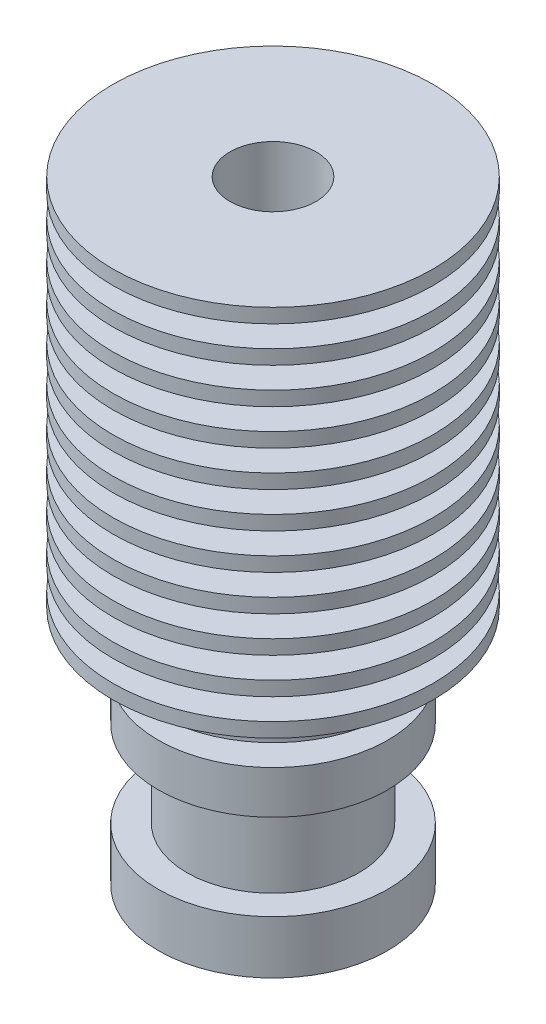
ISO-10303-21;
HEADER;
FILE_DESCRIPTION(('STEP AP214'),'2;1');
FILE_NAME('part.step','',(''),(''),'','','');
FILE_SCHEMA(('AUTOMOTIVE_DESIGN { 1 0 10303 214 1 1 1 1 }'));
ENDSEC;
DATA;
#1=APPLICATION_CONTEXT('core data for automotive mechanical design processes');
#2=APPLICATION_PROTOCOL_DEFINITION('international standard','automotive_design',2000,#1);
#3=PRODUCT_CONTEXT('',#1,'mechanical');
#4=PRODUCT('Part','Part','',(#3));
#5=PRODUCT_RELATED_PRODUCT_CATEGORY('part','',(#4));
#6=PRODUCT_DEFINITION_FORMATION('','',#4);
#7=PRODUCT_DEFINITION_CONTEXT('part definition',#1,'design');
#8=PRODUCT_DEFINITION('design','',#6,#7);
#9=PRODUCT_DEFINITION_SHAPE('','',#8);
#10=(LENGTH_UNIT() NAMED_UNIT(*) SI_UNIT(.MILLI.,.METRE.));
#11=(NAMED_UNIT(*) PLANE_ANGLE_UNIT() SI_UNIT($,.RADIAN.));
#12=(NAMED_UNIT(*) SI_UNIT($,.STERADIAN.) SOLID_ANGLE_UNIT());
#13=UNCERTAINTY_MEASURE_WITH_UNIT(LENGTH_MEASURE(1.E-05),#10,'distance_accuracy_value','');
#14=(GEOMETRIC_REPRESENTATION_CONTEXT(3) GLOBAL_UNCERTAINTY_ASSIGNED_CONTEXT((#13)) GLOBAL_UNIT_ASSIGNED_CONTEXT((#10,
#11,#12)) REPRESENTATION_CONTEXT('',''));
#15=CARTESIAN_POINT('',(0.,0.,0.));
#16=DIRECTION('',(0.,0.,1.));
#17=DIRECTION('',(1.,0.,0.));
#18=AXIS2_PLACEMENT_3D('',#15,#16,#17);
#19=CARTESIAN_POINT('',(0.,0.,0.));
#20=DIRECTION('',(0.,1.,0.));
#21=DIRECTION('',(0.,0.,1.));
#22=AXIS2_PLACEMENT_3D('',#19,#20,#21);
#23=PLANE('',#22);
#24=CARTESIAN_POINT('',(0.,0.,0.));
#25=DIRECTION('',(0.,1.,0.));
#26=DIRECTION('',(0.,0.,1.));
#27=AXIS2_PLACEMENT_3D('',#24,#25,#26);
#28=CIRCLE('',#27,8.);
#29=CARTESIAN_POINT('',(0.,0.,8.));
#30=VERTEX_POINT('',#29);
#31=EDGE_CURVE('E161',#30,#30,#28,.T.);
#32=ORIENTED_EDGE('',*,*,#31,.F.);
#33=EDGE_LOOP('',(#32));
#34=FACE_BOUND('',#33,.T.);
#35=CARTESIAN_POINT('',(0.,0.,0.));
#36=DIRECTION('',(0.,-1.,0.));
#37=DIRECTION('',(0.,0.,-1.));
#38=AXIS2_PLACEMENT_3D('',#35,#36,#37);
#39=CIRCLE('',#38,2.1);
#40=CARTESIAN_POINT('',(0.,0.,-2.1));
#41=VERTEX_POINT('',#40);
#42=EDGE_CURVE('E848',#41,#41,#39,.T.);
#43=ORIENTED_EDGE('',*,*,#42,.F.);
#44=EDGE_LOOP('',(#43));
#45=FACE_BOUND('',#44,.T.);
#46=ADVANCED_FACE('F35',(#34,#45),#23,.F.);
#47=CARTESIAN_POINT('',(0.,12.7,0.));
#48=DIRECTION('',(0.,1.,0.));
#49=DIRECTION('',(0.,0.,1.));
#50=AXIS2_PLACEMENT_3D('',#47,#48,#49);
#51=CONICAL_SURFACE('',#50,4.5,0.05235987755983);
#52=CARTESIAN_POINT('',(0.,40.2,0.));
#53=DIRECTION('',(0.,1.,0.));
#54=DIRECTION('',(0.,0.,1.));
#55=AXIS2_PLACEMENT_3D('',#52,#53,#54);
#56=CIRCLE('',#55,5.94121393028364);
#57=CARTESIAN_POINT('',(0.,40.2,5.94121393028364));
#58=VERTEX_POINT('',#57);
#59=EDGE_CURVE('E55',#58,#58,#56,.T.);
#60=ORIENTED_EDGE('',*,*,#59,.T.);
#61=EDGE_LOOP('',(#60));
#62=FACE_BOUND('',#61,.T.);
#63=CARTESIAN_POINT('',(0.,41.7,0.));
#64=DIRECTION('',(0.,1.,0.));
#65=DIRECTION('',(0.,0.,1.));
#66=AXIS2_PLACEMENT_3D('',#63,#64,#65);
#67=CIRCLE('',#66,6.0198255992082);
#68=CARTESIAN_POINT('',(0.,41.7,6.0198255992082));
#69=VERTEX_POINT('',#68);
#70=EDGE_CURVE('E10',#69,#69,#67,.T.);
#71=ORIENTED_EDGE('',*,*,#70,.F.);
#72=EDGE_LOOP('',(#71));
#73=FACE_BOUND('',#72,.T.);
#74=ADVANCED_FACE('F237',(#62,#73),#51,.T.);
#75=CARTESIAN_POINT('',(0.,37.7,0.));
#76=DIRECTION('',(0.,1.,0.));
#77=DIRECTION('',(0.,0.,1.));
#78=AXIS2_PLACEMENT_3D('',#75,#76,#77);
#79=CIRCLE('',#78,5.81019448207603);
#80=CARTESIAN_POINT('',(0.,37.7,5.81019448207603));
#81=VERTEX_POINT('',#80);
#82=EDGE_CURVE('E54',#81,#81,#79,.T.);
#83=ORIENTED_EDGE('',*,*,#82,.T.);
#84=EDGE_LOOP('',(#83));
#85=FACE_BOUND('',#84,.T.);
#86=CARTESIAN_POINT('',(0.,39.2,0.));
#87=DIRECTION('',(0.,1.,0.));
#88=DIRECTION('',(0.,0.,1.));
#89=AXIS2_PLACEMENT_3D('',#86,#87,#88);
#90=CIRCLE('',#89,5.8888061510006);
#91=CARTESIAN_POINT('',(0.,39.2,5.8888061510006));
#92=VERTEX_POINT('',#91);
#93=EDGE_CURVE('E42',#92,#92,#90,.T.);
#94=ORIENTED_EDGE('',*,*,#93,.F.);
#95=EDGE_LOOP('',(#94));
#96=FACE_BOUND('',#95,.T.);
#97=ADVANCED_FACE('F242',(#85,#96),#51,.T.);
#98=CARTESIAN_POINT('',(0.,35.2,0.));
#99=DIRECTION('',(0.,1.,0.));
#100=DIRECTION('',(0.,0.,1.));
#101=AXIS2_PLACEMENT_3D('',#98,#99,#100);
#102=CIRCLE('',#101,5.67917503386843);
#103=CARTESIAN_POINT('',(0.,35.2,5.67917503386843));
#104=VERTEX_POINT('',#103);
#105=EDGE_CURVE('E81',#104,#104,#102,.T.);
#106=ORIENTED_EDGE('',*,*,#105,.T.);
#107=EDGE_LOOP('',(#106));
#108=FACE_BOUND('',#107,.T.);
#109=CARTESIAN_POINT('',(0.,36.7,0.));
#110=DIRECTION('',(0.,1.,0.));
#111=DIRECTION('',(0.,0.,1.));
#112=AXIS2_PLACEMENT_3D('',#109,#110,#111);
#113=CIRCLE('',#112,5.75778670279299);
#114=CARTESIAN_POINT('',(0.,36.7,5.75778670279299));
#115=VERTEX_POINT('',#114);
#116=EDGE_CURVE('E46',#115,#115,#113,.T.);
#117=ORIENTED_EDGE('',*,*,#116,.F.);
#118=EDGE_LOOP('',(#117));
#119=FACE_BOUND('',#118,.T.);
#120=ADVANCED_FACE('F216',(#108,#119),#51,.T.);
#121=CARTESIAN_POINT('',(0.,32.7,0.));
#122=DIRECTION('',(0.,1.,0.));
#123=DIRECTION('',(0.,0.,1.));
#124=AXIS2_PLACEMENT_3D('',#121,#122,#123);
#125=CIRCLE('',#124,5.54815558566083);
#126=CARTESIAN_POINT('',(0.,32.7,5.54815558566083));
#127=VERTEX_POINT('',#126);
#128=EDGE_CURVE('E88',#127,#127,#125,.T.);
#129=ORIENTED_EDGE('',*,*,#128,.T.);
#130=EDGE_LOOP('',(#129));
#131=FACE_BOUND('',#130,.T.);
#132=CARTESIAN_POINT('',(0.,34.2,0.));
#133=DIRECTION('',(0.,1.,0.));
#134=DIRECTION('',(0.,0.,1.));
#135=AXIS2_PLACEMENT_3D('',#132,#133,#134);
#136=CIRCLE('',#135,5.62676725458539);
#137=CARTESIAN_POINT('',(0.,34.2,5.62676725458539));
#138=VERTEX_POINT('',#137);
#139=EDGE_CURVE('E51',#138,#138,#136,.T.);
#140=ORIENTED_EDGE('',*,*,#139,.F.);
#141=EDGE_LOOP('',(#140));
#142=FACE_BOUND('',#141,.T.);
#143=ADVANCED_FACE('F391',(#131,#142),#51,.T.);
#144=CARTESIAN_POINT('',(0.,30.2,0.));
#145=DIRECTION('',(0.,1.,0.));
#146=DIRECTION('',(0.,0.,1.));
#147=AXIS2_PLACEMENT_3D('',#144,#145,#146);
#148=CIRCLE('',#147,5.41713613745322);
#149=CARTESIAN_POINT('',(0.,30.2,5.41713613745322));
#150=VERTEX_POINT('',#149);
#151=EDGE_CURVE('E95',#150,#150,#148,.T.);
#152=ORIENTED_EDGE('',*,*,#151,.T.);
#153=EDGE_LOOP('',(#152));
#154=FACE_BOUND('',#153,.T.);
#155=CARTESIAN_POINT('',(0.,31.7,0.));
#156=DIRECTION('',(0.,1.,0.));
#157=DIRECTION('',(0.,0.,1.));
#158=AXIS2_PLACEMENT_3D('',#155,#156,#157);
#159=CIRCLE('',#158,5.49574780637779);
#160=CARTESIAN_POINT('',(0.,31.7,5.49574780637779));
#161=VERTEX_POINT('',#160);
#162=EDGE_CURVE('E204',#161,#161,#159,.T.);
#163=ORIENTED_EDGE('',*,*,#162,.F.);
#164=EDGE_LOOP('',(#163));
#165=FACE_BOUND('',#164,.T.);
#166=ADVANCED_FACE('F393',(#154,#165),#51,.T.);
#167=CARTESIAN_POINT('',(0.,27.7,0.));
#168=DIRECTION('',(0.,1.,0.));
#169=DIRECTION('',(0.,0.,1.));
#170=AXIS2_PLACEMENT_3D('',#167,#168,#169);
#171=CIRCLE('',#170,5.28611668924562);
#172=CARTESIAN_POINT('',(0.,27.7,5.28611668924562));
#173=VERTEX_POINT('',#172);
#174=EDGE_CURVE('E102',#173,#173,#171,.T.);
#175=ORIENTED_EDGE('',*,*,#174,.T.);
#176=EDGE_LOOP('',(#175));
#177=FACE_BOUND('',#176,.T.);
#178=CARTESIAN_POINT('',(0.,29.2,0.));
#179=DIRECTION('',(0.,1.,0.));
#180=DIRECTION('',(0.,0.,1.));
#181=AXIS2_PLACEMENT_3D('',#178,#179,#180);
#182=CIRCLE('',#181,5.36472835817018);
#183=CARTESIAN_POINT('',(0.,29.2,5.36472835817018));
#184=VERTEX_POINT('',#183);
#185=EDGE_CURVE('E199',#184,#184,#182,.T.);
#186=ORIENTED_EDGE('',*,*,#185,.F.);
#187=EDGE_LOOP('',(#186));
#188=FACE_BOUND('',#187,.T.);
#189=ADVANCED_FACE('F399',(#177,#188),#51,.T.);
#190=CARTESIAN_POINT('',(0.,25.2,0.));
#191=DIRECTION('',(0.,1.,0.));
#192=DIRECTION('',(0.,0.,1.));
#193=AXIS2_PLACEMENT_3D('',#190,#191,#192);
#194=CIRCLE('',#193,5.15509724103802);
#195=CARTESIAN_POINT('',(0.,25.2,5.15509724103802));
#196=VERTEX_POINT('',#195);
#197=EDGE_CURVE('E109',#196,#196,#194,.T.);
#198=ORIENTED_EDGE('',*,*,#197,.T.);
#199=EDGE_LOOP('',(#198));
#200=FACE_BOUND('',#199,.T.);
#201=CARTESIAN_POINT('',(0.,26.7,0.));
#202=DIRECTION('',(0.,1.,0.));
#203=DIRECTION('',(0.,0.,1.));
#204=AXIS2_PLACEMENT_3D('',#201,#202,#203);
#205=CIRCLE('',#204,5.23370890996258);
#206=CARTESIAN_POINT('',(0.,26.7,5.23370890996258));
#207=VERTEX_POINT('',#206);
#208=EDGE_CURVE('E194',#207,#207,#205,.T.);
#209=ORIENTED_EDGE('',*,*,#208,.F.);
#210=EDGE_LOOP('',(#209));
#211=FACE_BOUND('',#210,.T.);
#212=ADVANCED_FACE('F764',(#200,#211),#51,.T.);
#213=CARTESIAN_POINT('',(0.,22.7,0.));
#214=DIRECTION('',(0.,1.,0.));
#215=DIRECTION('',(0.,0.,1.));
#216=AXIS2_PLACEMENT_3D('',#213,#214,#215);
#217=CIRCLE('',#216,5.02407779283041);
#218=CARTESIAN_POINT('',(0.,22.7,5.02407779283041));
#219=VERTEX_POINT('',#218);
#220=EDGE_CURVE('E116',#219,#219,#217,.T.);
#221=ORIENTED_EDGE('',*,*,#220,.T.);
#222=EDGE_LOOP('',(#221));
#223=FACE_BOUND('',#222,.T.);
#224=CARTESIAN_POINT('',(0.,24.2,0.));
#225=DIRECTION('',(0.,1.,0.));
#226=DIRECTION('',(0.,0.,1.));
#227=AXIS2_PLACEMENT_3D('',#224,#225,#226);
#228=CIRCLE('',#227,5.10268946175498);
#229=CARTESIAN_POINT('',(0.,24.2,5.10268946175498));
#230=VERTEX_POINT('',#229);
#231=EDGE_CURVE('E189',#230,#230,#228,.T.);
#232=ORIENTED_EDGE('',*,*,#231,.F.);
#233=EDGE_LOOP('',(#232));
#234=FACE_BOUND('',#233,.T.);
#235=ADVANCED_FACE('F755',(#223,#234),#51,.T.);
#236=CARTESIAN_POINT('',(0.,20.2,0.));
#237=DIRECTION('',(0.,1.,0.));
#238=DIRECTION('',(0.,0.,1.));
#239=AXIS2_PLACEMENT_3D('',#236,#237,#238);
#240=CIRCLE('',#239,4.89305834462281);
#241=CARTESIAN_POINT('',(0.,20.2,4.89305834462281));
#242=VERTEX_POINT('',#241);
#243=EDGE_CURVE('E123',#242,#242,#240,.T.);
#244=ORIENTED_EDGE('',*,*,#243,.T.);
#245=EDGE_LOOP('',(#244));
#246=FACE_BOUND('',#245,.T.);
#247=CARTESIAN_POINT('',(0.,21.7,0.));
#248=DIRECTION('',(0.,1.,0.));
#249=DIRECTION('',(0.,0.,1.));
#250=AXIS2_PLACEMENT_3D('',#247,#248,#249);
#251=CIRCLE('',#250,4.97167001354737);
#252=CARTESIAN_POINT('',(0.,21.7,4.97167001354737));
#253=VERTEX_POINT('',#252);
#254=EDGE_CURVE('E184',#253,#253,#251,.T.);
#255=ORIENTED_EDGE('',*,*,#254,.F.);
#256=EDGE_LOOP('',(#255));
#257=FACE_BOUND('',#256,.T.);
#258=ADVANCED_FACE('F746',(#246,#257),#51,.T.);
#259=CARTESIAN_POINT('',(0.,17.7,0.));
#260=DIRECTION('',(0.,1.,0.));
#261=DIRECTION('',(0.,0.,1.));
#262=AXIS2_PLACEMENT_3D('',#259,#260,#261);
#263=CIRCLE('',#262,4.76203889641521);
#264=CARTESIAN_POINT('',(0.,17.7,4.76203889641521));
#265=VERTEX_POINT('',#264);
#266=EDGE_CURVE('E130',#265,#265,#263,.T.);
#267=ORIENTED_EDGE('',*,*,#266,.T.);
#268=EDGE_LOOP('',(#267));
#269=FACE_BOUND('',#268,.T.);
#270=CARTESIAN_POINT('',(0.,19.2,0.));
#271=DIRECTION('',(0.,1.,0.));
#272=DIRECTION('',(0.,0.,1.));
#273=AXIS2_PLACEMENT_3D('',#270,#271,#272);
#274=CIRCLE('',#273,4.84065056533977);
#275=CARTESIAN_POINT('',(0.,19.2,4.84065056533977));
#276=VERTEX_POINT('',#275);
#277=EDGE_CURVE('E179',#276,#276,#274,.T.);
#278=ORIENTED_EDGE('',*,*,#277,.F.);
#279=EDGE_LOOP('',(#278));
#280=FACE_BOUND('',#279,.T.);
#281=ADVANCED_FACE('F447',(#269,#280),#51,.T.);
#282=CARTESIAN_POINT('',(0.,15.2,0.));
#283=DIRECTION('',(0.,1.,0.));
#284=DIRECTION('',(0.,0.,1.));
#285=AXIS2_PLACEMENT_3D('',#282,#283,#284);
#286=CIRCLE('',#285,4.6310194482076);
#287=CARTESIAN_POINT('',(0.,15.2,4.6310194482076));
#288=VERTEX_POINT('',#287);
#289=EDGE_CURVE('E137',#288,#288,#286,.T.);
#290=ORIENTED_EDGE('',*,*,#289,.T.);
#291=EDGE_LOOP('',(#290));
#292=FACE_BOUND('',#291,.T.);
#293=CARTESIAN_POINT('',(0.,16.7,0.));
#294=DIRECTION('',(0.,1.,0.));
#295=DIRECTION('',(0.,0.,1.));
#296=AXIS2_PLACEMENT_3D('',#293,#294,#295);
#297=CIRCLE('',#296,4.70963111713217);
#298=CARTESIAN_POINT('',(0.,16.7,4.70963111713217));
#299=VERTEX_POINT('',#298);
#300=EDGE_CURVE('E174',#299,#299,#297,.T.);
#301=ORIENTED_EDGE('',*,*,#300,.F.);
#302=EDGE_LOOP('',(#301));
#303=FACE_BOUND('',#302,.T.);
#304=ADVANCED_FACE('F443',(#292,#303),#51,.T.);
#305=CARTESIAN_POINT('',(0.,12.7,0.));
#306=DIRECTION('',(0.,1.,0.));
#307=DIRECTION('',(0.,0.,1.));
#308=AXIS2_PLACEMENT_3D('',#305,#306,#307);
#309=CIRCLE('',#308,4.5);
#310=CARTESIAN_POINT('',(0.,12.7,4.5));
#311=VERTEX_POINT('',#310);
#312=EDGE_CURVE('E148',#311,#311,#309,.T.);
#313=ORIENTED_EDGE('',*,*,#312,.T.);
#314=EDGE_LOOP('',(#313));
#315=FACE_BOUND('',#314,.T.);
#316=CARTESIAN_POINT('',(0.,14.2,0.));
#317=DIRECTION('',(0.,1.,0.));
#318=DIRECTION('',(0.,0.,1.));
#319=AXIS2_PLACEMENT_3D('',#316,#317,#318);
#320=CIRCLE('',#319,4.57861166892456);
#321=CARTESIAN_POINT('',(0.,14.2,4.57861166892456));
#322=VERTEX_POINT('',#321);
#323=EDGE_CURVE('E167',#322,#322,#320,.T.);
#324=ORIENTED_EDGE('',*,*,#323,.F.);
#325=EDGE_LOOP('',(#324));
#326=FACE_BOUND('',#325,.T.);
#327=ADVANCED_FACE('F244',(#315,#326),#51,.T.);
#328=CARTESIAN_POINT('',(0.,12.7,0.));
#329=DIRECTION('',(0.,1.,0.));
#330=DIRECTION('',(0.,0.,1.));
#331=AXIS2_PLACEMENT_3D('',#328,#329,#330);
#332=PLANE('',#331);
#333=CARTESIAN_POINT('',(0.,12.7,0.));
#334=DIRECTION('',(0.,1.,0.));
#335=DIRECTION('',(0.,0.,1.));
#336=AXIS2_PLACEMENT_3D('',#333,#334,#335);
#337=CIRCLE('',#336,8.);
#338=CARTESIAN_POINT('',(0.,12.7,8.));
#339=VERTEX_POINT('',#338);
#340=EDGE_CURVE('E152',#339,#339,#337,.T.);
#341=ORIENTED_EDGE('',*,*,#340,.T.);
#342=EDGE_LOOP('',(#341));
#343=FACE_BOUND('',#342,.T.);
#344=ORIENTED_EDGE('',*,*,#312,.F.);
#345=EDGE_LOOP('',(#344));
#346=FACE_BOUND('',#345,.T.);
#347=ADVANCED_FACE('F251',(#343,#346),#332,.T.);
#348=CARTESIAN_POINT('',(0.,3.7,0.));
#349=DIRECTION('',(0.,1.,0.));
#350=DIRECTION('',(0.,0.,1.));
#351=AXIS2_PLACEMENT_3D('',#348,#349,#350);
#352=PLANE('',#351);
#353=CARTESIAN_POINT('',(0.,3.7,0.));
#354=DIRECTION('',(0.,1.,0.));
#355=DIRECTION('',(0.,0.,1.));
#356=AXIS2_PLACEMENT_3D('',#353,#354,#355);
#357=CIRCLE('',#356,8.);
#358=CARTESIAN_POINT('',(0.,3.7,8.));
#359=VERTEX_POINT('',#358);
#360=EDGE_CURVE('E164',#359,#359,#357,.T.);
#361=ORIENTED_EDGE('',*,*,#360,.T.);
#362=EDGE_LOOP('',(#361));
#363=FACE_BOUND('',#362,.T.);
#364=CARTESIAN_POINT('',(0.,3.7,0.));
#365=DIRECTION('',(0.,1.,0.));
#366=DIRECTION('',(0.,0.,1.));
#367=AXIS2_PLACEMENT_3D('',#364,#365,#366);
#368=CIRCLE('',#367,6.);
#369=CARTESIAN_POINT('',(0.,3.7,6.));
#370=VERTEX_POINT('',#369);
#371=EDGE_CURVE('E155',#370,#370,#368,.T.);
#372=ORIENTED_EDGE('',*,*,#371,.F.);
#373=EDGE_LOOP('',(#372));
#374=FACE_BOUND('',#373,.T.);
#375=ADVANCED_FACE('F248',(#363,#374),#352,.T.);
#376=CARTESIAN_POINT('',(0.,3.7,0.));
#377=DIRECTION('',(0.,-1.,0.));
#378=DIRECTION('',(0.,0.,-1.));
#379=AXIS2_PLACEMENT_3D('',#376,#377,#378);
#380=CYLINDRICAL_SURFACE('',#379,8.);
#381=ORIENTED_EDGE('',*,*,#360,.F.);
#382=EDGE_LOOP('',(#381));
#383=FACE_BOUND('',#382,.T.);
#384=ORIENTED_EDGE('',*,*,#31,.T.);
#385=EDGE_LOOP('',(#384));
#386=FACE_BOUND('',#385,.T.);
#387=ADVANCED_FACE('F37',(#383,#386),#380,.T.);
#388=CARTESIAN_POINT('',(0.,9.7,0.));
#389=DIRECTION('',(0.,-1.,0.));
#390=DIRECTION('',(0.,0.,-1.));
#391=AXIS2_PLACEMENT_3D('',#388,#389,#390);
#392=CYLINDRICAL_SURFACE('',#391,6.);
#393=CARTESIAN_POINT('',(0.,9.7,0.));
#394=DIRECTION('',(0.,1.,0.));
#395=DIRECTION('',(0.,0.,1.));
#396=AXIS2_PLACEMENT_3D('',#393,#394,#395);
#397=CIRCLE('',#396,6.);
#398=CARTESIAN_POINT('',(0.,9.7,6.));
#399=VERTEX_POINT('',#398);
#400=EDGE_CURVE('E158',#399,#399,#397,.T.);
#401=ORIENTED_EDGE('',*,*,#400,.F.);
#402=EDGE_LOOP('',(#401));
#403=FACE_BOUND('',#402,.T.);
#404=ORIENTED_EDGE('',*,*,#371,.T.);
#405=EDGE_LOOP('',(#404));
#406=FACE_BOUND('',#405,.T.);
#407=ADVANCED_FACE('F253',(#403,#406),#392,.T.);
#408=CARTESIAN_POINT('',(0.,9.7,0.));
#409=DIRECTION('',(0.,1.,0.));
#410=DIRECTION('',(0.,0.,1.));
#411=AXIS2_PLACEMENT_3D('',#408,#409,#410);
#412=PLANE('',#411);
#413=CARTESIAN_POINT('',(0.,9.7,0.));
#414=DIRECTION('',(0.,1.,0.));
#415=DIRECTION('',(0.,0.,1.));
#416=AXIS2_PLACEMENT_3D('',#413,#414,#415);
#417=CIRCLE('',#416,8.);
#418=CARTESIAN_POINT('',(0.,9.7,8.));
#419=VERTEX_POINT('',#418);
#420=EDGE_CURVE('E151',#419,#419,#417,.T.);
#421=ORIENTED_EDGE('',*,*,#420,.F.);
#422=EDGE_LOOP('',(#421));
#423=FACE_BOUND('',#422,.T.);
#424=ORIENTED_EDGE('',*,*,#400,.T.);
#425=EDGE_LOOP('',(#424));
#426=FACE_BOUND('',#425,.T.);
#427=ADVANCED_FACE('F256',(#423,#426),#412,.F.);
#428=CARTESIAN_POINT('',(0.,12.7,0.));
#429=DIRECTION('',(0.,-1.,0.));
#430=DIRECTION('',(0.,0.,-1.));
#431=AXIS2_PLACEMENT_3D('',#428,#429,#430);
#432=CYLINDRICAL_SURFACE('',#431,8.);
#433=ORIENTED_EDGE('',*,*,#340,.F.);
#434=EDGE_LOOP('',(#433));
#435=FACE_BOUND('',#434,.T.);
#436=ORIENTED_EDGE('',*,*,#420,.T.);
#437=EDGE_LOOP('',(#436));
#438=FACE_BOUND('',#437,.T.);
#439=ADVANCED_FACE('F258',(#435,#438),#432,.T.);
#440=CARTESIAN_POINT('',(0.,15.2,0.));
#441=DIRECTION('',(0.,1.,0.));
#442=DIRECTION('',(0.,0.,1.));
#443=AXIS2_PLACEMENT_3D('',#440,#441,#442);
#444=PLANE('',#443);
#445=CARTESIAN_POINT('',(0.,15.2,0.));
#446=DIRECTION('',(0.,1.,0.));
#447=DIRECTION('',(0.,0.,1.));
#448=AXIS2_PLACEMENT_3D('',#445,#446,#447);
#449=CIRCLE('',#448,8.);
#450=CARTESIAN_POINT('',(0.,15.2,8.));
#451=VERTEX_POINT('',#450);
#452=EDGE_CURVE('E134',#451,#451,#449,.T.);
#453=ORIENTED_EDGE('',*,*,#452,.T.);
#454=EDGE_LOOP('',(#453));
#455=FACE_BOUND('',#454,.T.);
#456=ORIENTED_EDGE('',*,*,#289,.F.);
#457=EDGE_LOOP('',(#456));
#458=FACE_BOUND('',#457,.T.);
#459=ADVANCED_FACE('F261',(#455,#458),#444,.T.);
#460=CARTESIAN_POINT('',(0.,14.2,0.));
#461=DIRECTION('',(0.,1.,0.));
#462=DIRECTION('',(0.,0.,1.));
#463=AXIS2_PLACEMENT_3D('',#460,#461,#462);
#464=PLANE('',#463);
#465=CARTESIAN_POINT('',(0.,14.2,0.));
#466=DIRECTION('',(0.,1.,0.));
#467=DIRECTION('',(0.,0.,1.));
#468=AXIS2_PLACEMENT_3D('',#465,#466,#467);
#469=CIRCLE('',#468,8.);
#470=CARTESIAN_POINT('',(0.,14.2,8.));
#471=VERTEX_POINT('',#470);
#472=EDGE_CURVE('E138',#471,#471,#469,.T.);
#473=ORIENTED_EDGE('',*,*,#472,.F.);
#474=EDGE_LOOP('',(#473));
#475=FACE_BOUND('',#474,.T.);
#476=ORIENTED_EDGE('',*,*,#323,.T.);
#477=EDGE_LOOP('',(#476));
#478=FACE_BOUND('',#477,.T.);
#479=ADVANCED_FACE('F290',(#475,#478),#464,.F.);
#480=CARTESIAN_POINT('',(0.,15.2,0.));
#481=DIRECTION('',(0.,-1.,0.));
#482=DIRECTION('',(0.,0.,-1.));
#483=AXIS2_PLACEMENT_3D('',#480,#481,#482);
#484=CYLINDRICAL_SURFACE('',#483,8.);
#485=ORIENTED_EDGE('',*,*,#452,.F.);
#486=EDGE_LOOP('',(#485));
#487=FACE_BOUND('',#486,.T.);
#488=ORIENTED_EDGE('',*,*,#472,.T.);
#489=EDGE_LOOP('',(#488));
#490=FACE_BOUND('',#489,.T.);
#491=ADVANCED_FACE('F286',(#487,#490),#484,.T.);
#492=CARTESIAN_POINT('',(0.,17.7,0.));
#493=DIRECTION('',(0.,1.,0.));
#494=DIRECTION('',(0.,0.,1.));
#495=AXIS2_PLACEMENT_3D('',#492,#493,#494);
#496=PLANE('',#495);
#497=CARTESIAN_POINT('',(0.,17.7,0.));
#498=DIRECTION('',(0.,1.,0.));
#499=DIRECTION('',(0.,0.,1.));
#500=AXIS2_PLACEMENT_3D('',#497,#498,#499);
#501=CIRCLE('',#500,11.15);
#502=CARTESIAN_POINT('',(0.,17.7,11.15));
#503=VERTEX_POINT('',#502);
#504=EDGE_CURVE('E127',#503,#503,#501,.T.);
#505=ORIENTED_EDGE('',*,*,#504,.T.);
#506=EDGE_LOOP('',(#505));
#507=FACE_BOUND('',#506,.T.);
#508=ORIENTED_EDGE('',*,*,#266,.F.);
#509=EDGE_LOOP('',(#508));
#510=FACE_BOUND('',#509,.T.);
#511=ADVANCED_FACE('F289',(#507,#510),#496,.T.);
#512=CARTESIAN_POINT('',(0.,16.7,0.));
#513=DIRECTION('',(0.,1.,0.));
#514=DIRECTION('',(0.,0.,1.));
#515=AXIS2_PLACEMENT_3D('',#512,#513,#514);
#516=PLANE('',#515);
#517=CARTESIAN_POINT('',(0.,16.7,0.));
#518=DIRECTION('',(0.,1.,0.));
#519=DIRECTION('',(0.,0.,1.));
#520=AXIS2_PLACEMENT_3D('',#517,#518,#519);
#521=CIRCLE('',#520,11.15);
#522=CARTESIAN_POINT('',(0.,16.7,11.15));
#523=VERTEX_POINT('',#522);
#524=EDGE_CURVE('E131',#523,#523,#521,.T.);
#525=ORIENTED_EDGE('',*,*,#524,.F.);
#526=EDGE_LOOP('',(#525));
#527=FACE_BOUND('',#526,.T.);
#528=ORIENTED_EDGE('',*,*,#300,.T.);
#529=EDGE_LOOP('',(#528));
#530=FACE_BOUND('',#529,.T.);
#531=ADVANCED_FACE('F302',(#527,#530),#516,.F.);
#532=CARTESIAN_POINT('',(0.,17.7,0.));
#533=DIRECTION('',(0.,-1.,0.));
#534=DIRECTION('',(0.,0.,-1.));
#535=AXIS2_PLACEMENT_3D('',#532,#533,#534);
#536=CYLINDRICAL_SURFACE('',#535,11.15);
#537=ORIENTED_EDGE('',*,*,#504,.F.);
#538=EDGE_LOOP('',(#537));
#539=FACE_BOUND('',#538,.T.);
#540=ORIENTED_EDGE('',*,*,#524,.T.);
#541=EDGE_LOOP('',(#540));
#542=FACE_BOUND('',#541,.T.);
#543=ADVANCED_FACE('F298',(#539,#542),#536,.T.);
#544=CARTESIAN_POINT('',(0.,20.2,0.));
#545=DIRECTION('',(0.,1.,0.));
#546=DIRECTION('',(0.,0.,1.));
#547=AXIS2_PLACEMENT_3D('',#544,#545,#546);
#548=PLANE('',#547);
#549=CARTESIAN_POINT('',(0.,20.2,0.));
#550=DIRECTION('',(0.,1.,0.));
#551=DIRECTION('',(0.,0.,1.));
#552=AXIS2_PLACEMENT_3D('',#549,#550,#551);
#553=CIRCLE('',#552,11.15);
#554=CARTESIAN_POINT('',(0.,20.2,11.15));
#555=VERTEX_POINT('',#554);
#556=EDGE_CURVE('E120',#555,#555,#553,.T.);
#557=ORIENTED_EDGE('',*,*,#556,.T.);
#558=EDGE_LOOP('',(#557));
#559=FACE_BOUND('',#558,.T.);
#560=ORIENTED_EDGE('',*,*,#243,.F.);
#561=EDGE_LOOP('',(#560));
#562=FACE_BOUND('',#561,.T.);
#563=ADVANCED_FACE('F301',(#559,#562),#548,.T.);
#564=CARTESIAN_POINT('',(0.,19.2,0.));
#565=DIRECTION('',(0.,1.,0.));
#566=DIRECTION('',(0.,0.,1.));
#567=AXIS2_PLACEMENT_3D('',#564,#565,#566);
#568=PLANE('',#567);
#569=CARTESIAN_POINT('',(0.,19.2,0.));
#570=DIRECTION('',(0.,1.,0.));
#571=DIRECTION('',(0.,0.,1.));
#572=AXIS2_PLACEMENT_3D('',#569,#570,#571);
#573=CIRCLE('',#572,11.15);
#574=CARTESIAN_POINT('',(0.,19.2,11.15));
#575=VERTEX_POINT('',#574);
#576=EDGE_CURVE('E124',#575,#575,#573,.T.);
#577=ORIENTED_EDGE('',*,*,#576,.F.);
#578=EDGE_LOOP('',(#577));
#579=FACE_BOUND('',#578,.T.);
#580=ORIENTED_EDGE('',*,*,#277,.T.);
#581=EDGE_LOOP('',(#580));
#582=FACE_BOUND('',#581,.T.);
#583=ADVANCED_FACE('F314',(#579,#582),#568,.F.);
#584=CARTESIAN_POINT('',(0.,20.2,0.));
#585=DIRECTION('',(0.,-1.,0.));
#586=DIRECTION('',(0.,0.,-1.));
#587=AXIS2_PLACEMENT_3D('',#584,#585,#586);
#588=CYLINDRICAL_SURFACE('',#587,11.15);
#589=ORIENTED_EDGE('',*,*,#556,.F.);
#590=EDGE_LOOP('',(#589));
#591=FACE_BOUND('',#590,.T.);
#592=ORIENTED_EDGE('',*,*,#576,.T.);
#593=EDGE_LOOP('',(#592));
#594=FACE_BOUND('',#593,.T.);
#595=ADVANCED_FACE('F310',(#591,#594),#588,.T.);
#596=CARTESIAN_POINT('',(0.,22.7,0.));
#597=DIRECTION('',(0.,1.,0.));
#598=DIRECTION('',(0.,0.,1.));
#599=AXIS2_PLACEMENT_3D('',#596,#597,#598);
#600=PLANE('',#599);
#601=CARTESIAN_POINT('',(0.,22.7,0.));
#602=DIRECTION('',(0.,1.,0.));
#603=DIRECTION('',(0.,0.,1.));
#604=AXIS2_PLACEMENT_3D('',#601,#602,#603);
#605=CIRCLE('',#604,11.15);
#606=CARTESIAN_POINT('',(0.,22.7,11.15));
#607=VERTEX_POINT('',#606);
#608=EDGE_CURVE('E113',#607,#607,#605,.T.);
#609=ORIENTED_EDGE('',*,*,#608,.T.);
#610=EDGE_LOOP('',(#609));
#611=FACE_BOUND('',#610,.T.);
#612=ORIENTED_EDGE('',*,*,#220,.F.);
#613=EDGE_LOOP('',(#612));
#614=FACE_BOUND('',#613,.T.);
#615=ADVANCED_FACE('F313',(#611,#614),#600,.T.);
#616=CARTESIAN_POINT('',(0.,21.7,0.));
#617=DIRECTION('',(0.,1.,0.));
#618=DIRECTION('',(0.,0.,1.));
#619=AXIS2_PLACEMENT_3D('',#616,#617,#618);
#620=PLANE('',#619);
#621=CARTESIAN_POINT('',(0.,21.7,0.));
#622=DIRECTION('',(0.,1.,0.));
#623=DIRECTION('',(0.,0.,1.));
#624=AXIS2_PLACEMENT_3D('',#621,#622,#623);
#625=CIRCLE('',#624,11.15);
#626=CARTESIAN_POINT('',(0.,21.7,11.15));
#627=VERTEX_POINT('',#626);
#628=EDGE_CURVE('E117',#627,#627,#625,.T.);
#629=ORIENTED_EDGE('',*,*,#628,.F.);
#630=EDGE_LOOP('',(#629));
#631=FACE_BOUND('',#630,.T.);
#632=ORIENTED_EDGE('',*,*,#254,.T.);
#633=EDGE_LOOP('',(#632));
#634=FACE_BOUND('',#633,.T.);
#635=ADVANCED_FACE('F326',(#631,#634),#620,.F.);
#636=CARTESIAN_POINT('',(0.,22.7,0.));
#637=DIRECTION('',(0.,-1.,0.));
#638=DIRECTION('',(0.,0.,-1.));
#639=AXIS2_PLACEMENT_3D('',#636,#637,#638);
#640=CYLINDRICAL_SURFACE('',#639,11.15);
#641=ORIENTED_EDGE('',*,*,#608,.F.);
#642=EDGE_LOOP('',(#641));
#643=FACE_BOUND('',#642,.T.);
#644=ORIENTED_EDGE('',*,*,#628,.T.);
#645=EDGE_LOOP('',(#644));
#646=FACE_BOUND('',#645,.T.);
#647=ADVANCED_FACE('F322',(#643,#646),#640,.T.);
#648=CARTESIAN_POINT('',(0.,25.2,0.));
#649=DIRECTION('',(0.,1.,0.));
#650=DIRECTION('',(0.,0.,1.));
#651=AXIS2_PLACEMENT_3D('',#648,#649,#650);
#652=PLANE('',#651);
#653=CARTESIAN_POINT('',(0.,25.2,0.));
#654=DIRECTION('',(0.,1.,0.));
#655=DIRECTION('',(0.,0.,1.));
#656=AXIS2_PLACEMENT_3D('',#653,#654,#655);
#657=CIRCLE('',#656,11.15);
#658=CARTESIAN_POINT('',(0.,25.2,11.15));
#659=VERTEX_POINT('',#658);
#660=EDGE_CURVE('E106',#659,#659,#657,.T.);
#661=ORIENTED_EDGE('',*,*,#660,.T.);
#662=EDGE_LOOP('',(#661));
#663=FACE_BOUND('',#662,.T.);
#664=ORIENTED_EDGE('',*,*,#197,.F.);
#665=EDGE_LOOP('',(#664));
#666=FACE_BOUND('',#665,.T.);
#667=ADVANCED_FACE('F325',(#663,#666),#652,.T.);
#668=CARTESIAN_POINT('',(0.,24.2,0.));
#669=DIRECTION('',(0.,1.,0.));
#670=DIRECTION('',(0.,0.,1.));
#671=AXIS2_PLACEMENT_3D('',#668,#669,#670);
#672=PLANE('',#671);
#673=CARTESIAN_POINT('',(0.,24.2,0.));
#674=DIRECTION('',(0.,1.,0.));
#675=DIRECTION('',(0.,0.,1.));
#676=AXIS2_PLACEMENT_3D('',#673,#674,#675);
#677=CIRCLE('',#676,11.15);
#678=CARTESIAN_POINT('',(0.,24.2,11.15));
#679=VERTEX_POINT('',#678);
#680=EDGE_CURVE('E110',#679,#679,#677,.T.);
#681=ORIENTED_EDGE('',*,*,#680,.F.);
#682=EDGE_LOOP('',(#681));
#683=FACE_BOUND('',#682,.T.);
#684=ORIENTED_EDGE('',*,*,#231,.T.);
#685=EDGE_LOOP('',(#684));
#686=FACE_BOUND('',#685,.T.);
#687=ADVANCED_FACE('F338',(#683,#686),#672,.F.);
#688=CARTESIAN_POINT('',(0.,25.2,0.));
#689=DIRECTION('',(0.,-1.,0.));
#690=DIRECTION('',(0.,0.,-1.));
#691=AXIS2_PLACEMENT_3D('',#688,#689,#690);
#692=CYLINDRICAL_SURFACE('',#691,11.15);
#693=ORIENTED_EDGE('',*,*,#660,.F.);
#694=EDGE_LOOP('',(#693));
#695=FACE_BOUND('',#694,.T.);
#696=ORIENTED_EDGE('',*,*,#680,.T.);
#697=EDGE_LOOP('',(#696));
#698=FACE_BOUND('',#697,.T.);
#699=ADVANCED_FACE('F334',(#695,#698),#692,.T.);
#700=CARTESIAN_POINT('',(0.,27.7,0.));
#701=DIRECTION('',(0.,1.,0.));
#702=DIRECTION('',(0.,0.,1.));
#703=AXIS2_PLACEMENT_3D('',#700,#701,#702);
#704=PLANE('',#703);
#705=CARTESIAN_POINT('',(0.,27.7,0.));
#706=DIRECTION('',(0.,1.,0.));
#707=DIRECTION('',(0.,0.,1.));
#708=AXIS2_PLACEMENT_3D('',#705,#706,#707);
#709=CIRCLE('',#708,11.15);
#710=CARTESIAN_POINT('',(0.,27.7,11.15));
#711=VERTEX_POINT('',#710);
#712=EDGE_CURVE('E99',#711,#711,#709,.T.);
#713=ORIENTED_EDGE('',*,*,#712,.T.);
#714=EDGE_LOOP('',(#713));
#715=FACE_BOUND('',#714,.T.);
#716=ORIENTED_EDGE('',*,*,#174,.F.);
#717=EDGE_LOOP('',(#716));
#718=FACE_BOUND('',#717,.T.);
#719=ADVANCED_FACE('F337',(#715,#718),#704,.T.);
#720=CARTESIAN_POINT('',(0.,26.7,0.));
#721=DIRECTION('',(0.,1.,0.));
#722=DIRECTION('',(0.,0.,1.));
#723=AXIS2_PLACEMENT_3D('',#720,#721,#722);
#724=PLANE('',#723);
#725=CARTESIAN_POINT('',(0.,26.7,0.));
#726=DIRECTION('',(0.,1.,0.));
#727=DIRECTION('',(0.,0.,1.));
#728=AXIS2_PLACEMENT_3D('',#725,#726,#727);
#729=CIRCLE('',#728,11.15);
#730=CARTESIAN_POINT('',(0.,26.7,11.15));
#731=VERTEX_POINT('',#730);
#732=EDGE_CURVE('E103',#731,#731,#729,.T.);
#733=ORIENTED_EDGE('',*,*,#732,.F.);
#734=EDGE_LOOP('',(#733));
#735=FACE_BOUND('',#734,.T.);
#736=ORIENTED_EDGE('',*,*,#208,.T.);
#737=EDGE_LOOP('',(#736));
#738=FACE_BOUND('',#737,.T.);
#739=ADVANCED_FACE('F350',(#735,#738),#724,.F.);
#740=CARTESIAN_POINT('',(0.,27.7,0.));
#741=DIRECTION('',(0.,-1.,0.));
#742=DIRECTION('',(0.,0.,-1.));
#743=AXIS2_PLACEMENT_3D('',#740,#741,#742);
#744=CYLINDRICAL_SURFACE('',#743,11.15);
#745=ORIENTED_EDGE('',*,*,#712,.F.);
#746=EDGE_LOOP('',(#745));
#747=FACE_BOUND('',#746,.T.);
#748=ORIENTED_EDGE('',*,*,#732,.T.);
#749=EDGE_LOOP('',(#748));
#750=FACE_BOUND('',#749,.T.);
#751=ADVANCED_FACE('F346',(#747,#750),#744,.T.);
#752=CARTESIAN_POINT('',(0.,30.2,0.));
#753=DIRECTION('',(0.,1.,0.));
#754=DIRECTION('',(0.,0.,1.));
#755=AXIS2_PLACEMENT_3D('',#752,#753,#754);
#756=PLANE('',#755);
#757=CARTESIAN_POINT('',(0.,30.2,0.));
#758=DIRECTION('',(0.,1.,0.));
#759=DIRECTION('',(0.,0.,1.));
#760=AXIS2_PLACEMENT_3D('',#757,#758,#759);
#761=CIRCLE('',#760,11.15);
#762=CARTESIAN_POINT('',(0.,30.2,11.15));
#763=VERTEX_POINT('',#762);
#764=EDGE_CURVE('E92',#763,#763,#761,.T.);
#765=ORIENTED_EDGE('',*,*,#764,.T.);
#766=EDGE_LOOP('',(#765));
#767=FACE_BOUND('',#766,.T.);
#768=ORIENTED_EDGE('',*,*,#151,.F.);
#769=EDGE_LOOP('',(#768));
#770=FACE_BOUND('',#769,.T.);
#771=ADVANCED_FACE('F349',(#767,#770),#756,.T.);
#772=CARTESIAN_POINT('',(0.,29.2,0.));
#773=DIRECTION('',(0.,1.,0.));
#774=DIRECTION('',(0.,0.,1.));
#775=AXIS2_PLACEMENT_3D('',#772,#773,#774);
#776=PLANE('',#775);
#777=CARTESIAN_POINT('',(0.,29.2,0.));
#778=DIRECTION('',(0.,1.,0.));
#779=DIRECTION('',(0.,0.,1.));
#780=AXIS2_PLACEMENT_3D('',#777,#778,#779);
#781=CIRCLE('',#780,11.15);
#782=CARTESIAN_POINT('',(0.,29.2,11.15));
#783=VERTEX_POINT('',#782);
#784=EDGE_CURVE('E96',#783,#783,#781,.T.);
#785=ORIENTED_EDGE('',*,*,#784,.F.);
#786=EDGE_LOOP('',(#785));
#787=FACE_BOUND('',#786,.T.);
#788=ORIENTED_EDGE('',*,*,#185,.T.);
#789=EDGE_LOOP('',(#788));
#790=FACE_BOUND('',#789,.T.);
#791=ADVANCED_FACE('F362',(#787,#790),#776,.F.);
#792=CARTESIAN_POINT('',(0.,30.2,0.));
#793=DIRECTION('',(0.,-1.,0.));
#794=DIRECTION('',(0.,0.,-1.));
#795=AXIS2_PLACEMENT_3D('',#792,#793,#794);
#796=CYLINDRICAL_SURFACE('',#795,11.15);
#797=ORIENTED_EDGE('',*,*,#764,.F.);
#798=EDGE_LOOP('',(#797));
#799=FACE_BOUND('',#798,.T.);
#800=ORIENTED_EDGE('',*,*,#784,.T.);
#801=EDGE_LOOP('',(#800));
#802=FACE_BOUND('',#801,.T.);
#803=ADVANCED_FACE('F358',(#799,#802),#796,.T.);
#804=CARTESIAN_POINT('',(0.,32.7,0.));
#805=DIRECTION('',(0.,1.,0.));
#806=DIRECTION('',(0.,0.,1.));
#807=AXIS2_PLACEMENT_3D('',#804,#805,#806);
#808=PLANE('',#807);
#809=CARTESIAN_POINT('',(0.,32.7,0.));
#810=DIRECTION('',(0.,1.,0.));
#811=DIRECTION('',(0.,0.,1.));
#812=AXIS2_PLACEMENT_3D('',#809,#810,#811);
#813=CIRCLE('',#812,11.15);
#814=CARTESIAN_POINT('',(0.,32.7,11.15));
#815=VERTEX_POINT('',#814);
#816=EDGE_CURVE('E85',#815,#815,#813,.T.);
#817=ORIENTED_EDGE('',*,*,#816,.T.);
#818=EDGE_LOOP('',(#817));
#819=FACE_BOUND('',#818,.T.);
#820=ORIENTED_EDGE('',*,*,#128,.F.);
#821=EDGE_LOOP('',(#820));
#822=FACE_BOUND('',#821,.T.);
#823=ADVANCED_FACE('F361',(#819,#822),#808,.T.);
#824=CARTESIAN_POINT('',(0.,31.7,0.));
#825=DIRECTION('',(0.,1.,0.));
#826=DIRECTION('',(0.,0.,1.));
#827=AXIS2_PLACEMENT_3D('',#824,#825,#826);
#828=PLANE('',#827);
#829=CARTESIAN_POINT('',(0.,31.7,0.));
#830=DIRECTION('',(0.,1.,0.));
#831=DIRECTION('',(0.,0.,1.));
#832=AXIS2_PLACEMENT_3D('',#829,#830,#831);
#833=CIRCLE('',#832,11.15);
#834=CARTESIAN_POINT('',(0.,31.7,11.15));
#835=VERTEX_POINT('',#834);
#836=EDGE_CURVE('E89',#835,#835,#833,.T.);
#837=ORIENTED_EDGE('',*,*,#836,.F.);
#838=EDGE_LOOP('',(#837));
#839=FACE_BOUND('',#838,.T.);
#840=ORIENTED_EDGE('',*,*,#162,.T.);
#841=EDGE_LOOP('',(#840));
#842=FACE_BOUND('',#841,.T.);
#843=ADVANCED_FACE('F232',(#839,#842),#828,.F.);
#844=CARTESIAN_POINT('',(0.,32.7,0.));
#845=DIRECTION('',(0.,-1.,0.));
#846=DIRECTION('',(0.,0.,-1.));
#847=AXIS2_PLACEMENT_3D('',#844,#845,#846);
#848=CYLINDRICAL_SURFACE('',#847,11.15);
#849=ORIENTED_EDGE('',*,*,#816,.F.);
#850=EDGE_LOOP('',(#849));
#851=FACE_BOUND('',#850,.T.);
#852=ORIENTED_EDGE('',*,*,#836,.T.);
#853=EDGE_LOOP('',(#852));
#854=FACE_BOUND('',#853,.T.);
#855=ADVANCED_FACE('F222',(#851,#854),#848,.T.);
#856=CARTESIAN_POINT('',(0.,35.2,0.));
#857=DIRECTION('',(0.,1.,0.));
#858=DIRECTION('',(0.,0.,1.));
#859=AXIS2_PLACEMENT_3D('',#856,#857,#858);
#860=PLANE('',#859);
#861=CARTESIAN_POINT('',(0.,35.2,0.));
#862=DIRECTION('',(0.,1.,0.));
#863=DIRECTION('',(0.,0.,1.));
#864=AXIS2_PLACEMENT_3D('',#861,#862,#863);
#865=CIRCLE('',#864,11.15);
#866=CARTESIAN_POINT('',(0.,35.2,11.15));
#867=VERTEX_POINT('',#866);
#868=EDGE_CURVE('E78',#867,#867,#865,.T.);
#869=ORIENTED_EDGE('',*,*,#868,.T.);
#870=EDGE_LOOP('',(#869));
#871=FACE_BOUND('',#870,.T.);
#872=ORIENTED_EDGE('',*,*,#105,.F.);
#873=EDGE_LOOP('',(#872));
#874=FACE_BOUND('',#873,.T.);
#875=ADVANCED_FACE('F219',(#871,#874),#860,.T.);
#876=CARTESIAN_POINT('',(0.,34.2,0.));
#877=DIRECTION('',(0.,1.,0.));
#878=DIRECTION('',(0.,0.,1.));
#879=AXIS2_PLACEMENT_3D('',#876,#877,#878);
#880=PLANE('',#879);
#881=CARTESIAN_POINT('',(0.,34.2,0.));
#882=DIRECTION('',(0.,1.,0.));
#883=DIRECTION('',(0.,0.,1.));
#884=AXIS2_PLACEMENT_3D('',#881,#882,#883);
#885=CIRCLE('',#884,11.15);
#886=CARTESIAN_POINT('',(0.,34.2,11.15));
#887=VERTEX_POINT('',#886);
#888=EDGE_CURVE('E82',#887,#887,#885,.T.);
#889=ORIENTED_EDGE('',*,*,#888,.F.);
#890=EDGE_LOOP('',(#889));
#891=FACE_BOUND('',#890,.T.);
#892=ORIENTED_EDGE('',*,*,#139,.T.);
#893=EDGE_LOOP('',(#892));
#894=FACE_BOUND('',#893,.T.);
#895=ADVANCED_FACE('F221',(#891,#894),#880,.F.);
#896=CARTESIAN_POINT('',(0.,35.2,0.));
#897=DIRECTION('',(0.,-1.,0.));
#898=DIRECTION('',(0.,0.,-1.));
#899=AXIS2_PLACEMENT_3D('',#896,#897,#898);
#900=CYLINDRICAL_SURFACE('',#899,11.15);
#901=ORIENTED_EDGE('',*,*,#868,.F.);
#902=EDGE_LOOP('',(#901));
#903=FACE_BOUND('',#902,.T.);
#904=ORIENTED_EDGE('',*,*,#888,.T.);
#905=EDGE_LOOP('',(#904));
#906=FACE_BOUND('',#905,.T.);
#907=ADVANCED_FACE('F229',(#903,#906),#900,.T.);
#908=CARTESIAN_POINT('',(0.,37.7,0.));
#909=DIRECTION('',(0.,1.,0.));
#910=DIRECTION('',(0.,0.,1.));
#911=AXIS2_PLACEMENT_3D('',#908,#909,#910);
#912=PLANE('',#911);
#913=CARTESIAN_POINT('',(0.,37.7,0.));
#914=DIRECTION('',(0.,1.,0.));
#915=DIRECTION('',(0.,0.,1.));
#916=AXIS2_PLACEMENT_3D('',#913,#914,#915);
#917=CIRCLE('',#916,11.15);
#918=CARTESIAN_POINT('',(0.,37.7,11.15));
#919=VERTEX_POINT('',#918);
#920=EDGE_CURVE('E62',#919,#919,#917,.T.);
#921=ORIENTED_EDGE('',*,*,#920,.T.);
#922=EDGE_LOOP('',(#921));
#923=FACE_BOUND('',#922,.T.);
#924=ORIENTED_EDGE('',*,*,#82,.F.);
#925=EDGE_LOOP('',(#924));
#926=FACE_BOUND('',#925,.T.);
#927=ADVANCED_FACE('F377',(#923,#926),#912,.T.);
#928=CARTESIAN_POINT('',(0.,36.7,0.));
#929=DIRECTION('',(0.,1.,0.));
#930=DIRECTION('',(0.,0.,1.));
#931=AXIS2_PLACEMENT_3D('',#928,#929,#930);
#932=PLANE('',#931);
#933=CARTESIAN_POINT('',(0.,36.7,0.));
#934=DIRECTION('',(0.,1.,0.));
#935=DIRECTION('',(0.,0.,1.));
#936=AXIS2_PLACEMENT_3D('',#933,#934,#935);
#937=CIRCLE('',#936,11.15);
#938=CARTESIAN_POINT('',(0.,36.7,11.15));
#939=VERTEX_POINT('',#938);
#940=EDGE_CURVE('E57',#939,#939,#937,.T.);
#941=ORIENTED_EDGE('',*,*,#940,.F.);
#942=EDGE_LOOP('',(#941));
#943=FACE_BOUND('',#942,.T.);
#944=ORIENTED_EDGE('',*,*,#116,.T.);
#945=EDGE_LOOP('',(#944));
#946=FACE_BOUND('',#945,.T.);
#947=ADVANCED_FACE('F382',(#943,#946),#932,.F.);
#948=CARTESIAN_POINT('',(0.,37.7,0.));
#949=DIRECTION('',(0.,-1.,0.));
#950=DIRECTION('',(0.,0.,-1.));
#951=AXIS2_PLACEMENT_3D('',#948,#949,#950);
#952=CYLINDRICAL_SURFACE('',#951,11.15);
#953=ORIENTED_EDGE('',*,*,#920,.F.);
#954=EDGE_LOOP('',(#953));
#955=FACE_BOUND('',#954,.T.);
#956=ORIENTED_EDGE('',*,*,#940,.T.);
#957=EDGE_LOOP('',(#956));
#958=FACE_BOUND('',#957,.T.);
#959=ADVANCED_FACE('F600',(#955,#958),#952,.T.);
#960=CARTESIAN_POINT('',(0.,40.2,0.));
#961=DIRECTION('',(0.,1.,0.));
#962=DIRECTION('',(0.,0.,1.));
#963=AXIS2_PLACEMENT_3D('',#960,#961,#962);
#964=PLANE('',#963);
#965=CARTESIAN_POINT('',(0.,40.2,0.));
#966=DIRECTION('',(0.,1.,0.));
#967=DIRECTION('',(0.,0.,1.));
#968=AXIS2_PLACEMENT_3D('',#965,#966,#967);
#969=CIRCLE('',#968,11.15);
#970=CARTESIAN_POINT('',(0.,40.2,11.15));
#971=VERTEX_POINT('',#970);
#972=EDGE_CURVE('E58',#971,#971,#969,.T.);
#973=ORIENTED_EDGE('',*,*,#972,.T.);
#974=EDGE_LOOP('',(#973));
#975=FACE_BOUND('',#974,.T.);
#976=ORIENTED_EDGE('',*,*,#59,.F.);
#977=EDGE_LOOP('',(#976));
#978=FACE_BOUND('',#977,.T.);
#979=ADVANCED_FACE('F592',(#975,#978),#964,.T.);
#980=CARTESIAN_POINT('',(0.,39.2,0.));
#981=DIRECTION('',(0.,1.,0.));
#982=DIRECTION('',(0.,0.,1.));
#983=AXIS2_PLACEMENT_3D('',#980,#981,#982);
#984=PLANE('',#983);
#985=CARTESIAN_POINT('',(0.,39.2,0.));
#986=DIRECTION('',(0.,1.,0.));
#987=DIRECTION('',(0.,0.,1.));
#988=AXIS2_PLACEMENT_3D('',#985,#986,#987);
#989=CIRCLE('',#988,11.15);
#990=CARTESIAN_POINT('',(0.,39.2,11.15));
#991=VERTEX_POINT('',#990);
#992=EDGE_CURVE('E65',#991,#991,#989,.T.);
#993=ORIENTED_EDGE('',*,*,#992,.F.);
#994=EDGE_LOOP('',(#993));
#995=FACE_BOUND('',#994,.T.);
#996=ORIENTED_EDGE('',*,*,#93,.T.);
#997=EDGE_LOOP('',(#996));
#998=FACE_BOUND('',#997,.T.);
#999=ADVANCED_FACE('F584',(#995,#998),#984,.F.);
#1000=CARTESIAN_POINT('',(0.,40.2,0.));
#1001=DIRECTION('',(0.,-1.,0.));
#1002=DIRECTION('',(0.,0.,-1.));
#1003=AXIS2_PLACEMENT_3D('',#1000,#1001,#1002);
#1004=CYLINDRICAL_SURFACE('',#1003,11.15);
#1005=ORIENTED_EDGE('',*,*,#972,.F.);
#1006=EDGE_LOOP('',(#1005));
#1007=FACE_BOUND('',#1006,.T.);
#1008=ORIENTED_EDGE('',*,*,#992,.T.);
#1009=EDGE_LOOP('',(#1008));
#1010=FACE_BOUND('',#1009,.T.);
#1011=ADVANCED_FACE('F577',(#1007,#1010),#1004,.T.);
#1012=CARTESIAN_POINT('',(0.,41.7,0.));
#1013=DIRECTION('',(0.,1.,0.));
#1014=DIRECTION('',(0.,0.,1.));
#1015=AXIS2_PLACEMENT_3D('',#1012,#1013,#1014);
#1016=PLANE('',#1015);
#1017=CARTESIAN_POINT('',(0.,41.7,0.));
#1018=DIRECTION('',(0.,1.,0.));
#1019=DIRECTION('',(0.,0.,1.));
#1020=AXIS2_PLACEMENT_3D('',#1017,#1018,#1019);
#1021=CIRCLE('',#1020,11.15);
#1022=CARTESIAN_POINT('',(0.,41.7,11.15));
#1023=VERTEX_POINT('',#1022);
#1024=EDGE_CURVE('E73',#1023,#1023,#1021,.T.);
#1025=ORIENTED_EDGE('',*,*,#1024,.F.);
#1026=EDGE_LOOP('',(#1025));
#1027=FACE_BOUND('',#1026,.T.);
#1028=ORIENTED_EDGE('',*,*,#70,.T.);
#1029=EDGE_LOOP('',(#1028));
#1030=FACE_BOUND('',#1029,.T.);
#1031=ADVANCED_FACE('F570',(#1027,#1030),#1016,.F.);
#1032=CARTESIAN_POINT('',(0.,42.7,0.));
#1033=DIRECTION('',(0.,-1.,0.));
#1034=DIRECTION('',(0.,0.,-1.));
#1035=AXIS2_PLACEMENT_3D('',#1032,#1033,#1034);
#1036=CYLINDRICAL_SURFACE('',#1035,11.15);
#1037=CARTESIAN_POINT('',(0.,42.7,0.));
#1038=DIRECTION('',(0.,1.,0.));
#1039=DIRECTION('',(0.,0.,1.));
#1040=AXIS2_PLACEMENT_3D('',#1037,#1038,#1039);
#1041=CIRCLE('',#1040,11.15);
#1042=CARTESIAN_POINT('',(0.,42.7,11.15));
#1043=VERTEX_POINT('',#1042);
#1044=EDGE_CURVE('E70',#1043,#1043,#1041,.T.);
#1045=ORIENTED_EDGE('',*,*,#1044,.F.);
#1046=EDGE_LOOP('',(#1045));
#1047=FACE_BOUND('',#1046,.T.);
#1048=ORIENTED_EDGE('',*,*,#1024,.T.);
#1049=EDGE_LOOP('',(#1048));
#1050=FACE_BOUND('',#1049,.T.);
#1051=ADVANCED_FACE('F272',(#1047,#1050),#1036,.T.);
#1052=CARTESIAN_POINT('',(0.,12.7,0.));
#1053=DIRECTION('',(0.,-1.,0.));
#1054=DIRECTION('',(0.,0.,-1.));
#1055=AXIS2_PLACEMENT_3D('',#1052,#1053,#1054);
#1056=CYLINDRICAL_SURFACE('',#1055,2.1);
#1057=CARTESIAN_POINT('',(0.,27.3592254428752,0.));
#1058=DIRECTION('',(0.,1.,0.));
#1059=DIRECTION('',(0.,0.,1.));
#1060=AXIS2_PLACEMENT_3D('',#1057,#1058,#1059);
#1061=CIRCLE('',#1060,2.1);
#1062=CARTESIAN_POINT('',(0.,27.3592254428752,2.1));
#1063=VERTEX_POINT('',#1062);
#1064=EDGE_CURVE('E147',#1063,#1063,#1061,.F.);
#1065=ORIENTED_EDGE('',*,*,#1064,.F.);
#1066=EDGE_LOOP('',(#1065));
#1067=FACE_BOUND('',#1066,.T.);
#1068=ORIENTED_EDGE('',*,*,#42,.T.);
#1069=EDGE_LOOP('',(#1068));
#1070=FACE_BOUND('',#1069,.T.);
#1071=ADVANCED_FACE('F269',(#1067,#1070),#1056,.F.);
#1072=CARTESIAN_POINT('',(0.,27.9,0.));
#1073=DIRECTION('',(0.,1.,0.));
#1074=DIRECTION('',(0.,0.,1.));
#1075=AXIS2_PLACEMENT_3D('',#1072,#1073,#1074);
#1076=CONICAL_SURFACE('',#1075,3.,1.02974425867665);
#1077=ORIENTED_EDGE('',*,*,#1064,.T.);
#1078=EDGE_LOOP('',(#1077));
#1079=FACE_BOUND('',#1078,.T.);
#1080=CARTESIAN_POINT('',(0.,27.9,0.));
#1081=DIRECTION('',(0.,1.,0.));
#1082=DIRECTION('',(0.,0.,1.));
#1083=AXIS2_PLACEMENT_3D('',#1080,#1081,#1082);
#1084=CIRCLE('',#1083,3.);
#1085=CARTESIAN_POINT('',(0.,27.9,3.));
#1086=VERTEX_POINT('',#1085);
#1087=EDGE_CURVE('E144',#1086,#1086,#1084,.T.);
#1088=ORIENTED_EDGE('',*,*,#1087,.T.);
#1089=EDGE_LOOP('',(#1088));
#1090=FACE_BOUND('',#1089,.T.);
#1091=ADVANCED_FACE('F271',(#1079,#1090),#1076,.F.);
#1092=CARTESIAN_POINT('',(0.,42.7,0.));
#1093=DIRECTION('',(0.,1.,0.));
#1094=DIRECTION('',(0.,0.,1.));
#1095=AXIS2_PLACEMENT_3D('',#1092,#1093,#1094);
#1096=CYLINDRICAL_SURFACE('',#1095,3.);
#1097=ORIENTED_EDGE('',*,*,#1087,.F.);
#1098=EDGE_LOOP('',(#1097));
#1099=FACE_BOUND('',#1098,.T.);
#1100=CARTESIAN_POINT('',(0.,42.7,0.));
#1101=DIRECTION('',(0.,1.,0.));
#1102=DIRECTION('',(0.,0.,1.));
#1103=AXIS2_PLACEMENT_3D('',#1100,#1101,#1102);
#1104=CIRCLE('',#1103,3.);
#1105=CARTESIAN_POINT('',(0.,42.7,3.));
#1106=VERTEX_POINT('',#1105);
#1107=EDGE_CURVE('E141',#1106,#1106,#1104,.T.);
#1108=ORIENTED_EDGE('',*,*,#1107,.T.);
#1109=EDGE_LOOP('',(#1108));
#1110=FACE_BOUND('',#1109,.T.);
#1111=ADVANCED_FACE('F278',(#1099,#1110),#1096,.F.);
#1112=CARTESIAN_POINT('',(0.,42.7,0.));
#1113=DIRECTION('',(0.,1.,0.));
#1114=DIRECTION('',(0.,0.,1.));
#1115=AXIS2_PLACEMENT_3D('',#1112,#1113,#1114);
#1116=PLANE('',#1115);
#1117=ORIENTED_EDGE('',*,*,#1107,.F.);
#1118=EDGE_LOOP('',(#1117));
#1119=FACE_BOUND('',#1118,.T.);
#1120=ORIENTED_EDGE('',*,*,#1044,.T.);
#1121=EDGE_LOOP('',(#1120));
#1122=FACE_BOUND('',#1121,.T.);
#1123=ADVANCED_FACE('F275',(#1119,#1122),#1116,.T.);
#1124=CLOSED_SHELL('',(#46,#74,#97,#120,#143,#166,#189,#212,#235,#258,#281,#304,#327,#347,#375,
#387,#407,#427,#439,#459,#479,#491,#511,#531,#543,#563,#583,#595,#615,#635,#647,#667,#687,#699,
#719,#739,#751,#771,#791,#803,#823,#843,#855,#875,#895,#907,#927,#947,#959,#979,#999,#1011,
#1031,#1051,#1071,#1091,#1111,#1123));
#1125=MANIFOLD_SOLID_BREP('B2',#1124);
#1126=ADVANCED_BREP_SHAPE_REPRESENTATION('',(#18,#1125),#14);
#1127=SHAPE_DEFINITION_REPRESENTATION(#9,#1126);
ENDSEC;
END-ISO-10303-21;
